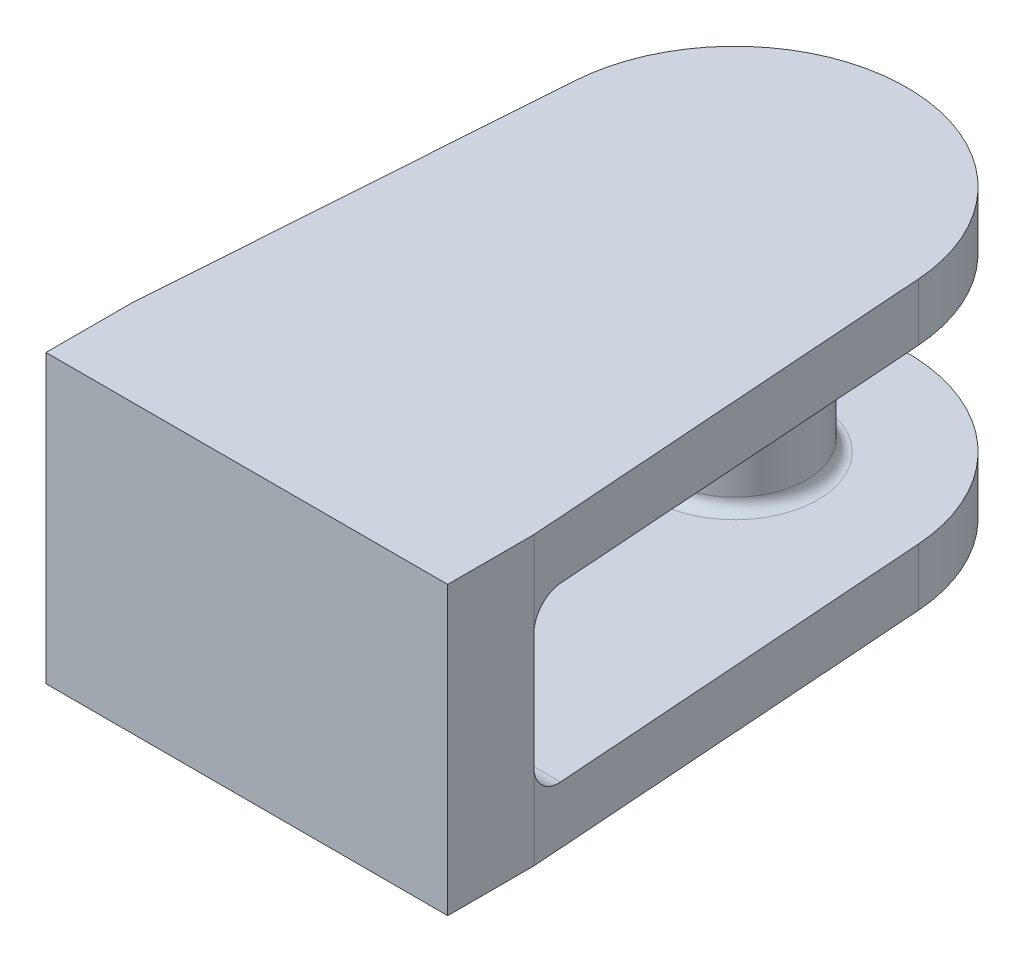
from build123d import *

# Parameters (mm, degrees)
SKETCH1_R      = 15.875
EXTRUDE1_DEPTH = 38.1
EXTRUDE2_DEPTH = 12.7
EXTRUDE5_START = 12.7
EXTRUDE5_DEPTH = 12.7
SKETCH6_W      = 88.9
SKETCH6_H      = 63.5
EXTRUDE6_DEPTH = 19.05
FILLET3_R      = 6.35
FILLET4_R      = 2.54


with BuildPart() as part:
    # Sketch1 → Extrude1 (new body)
    with BuildSketch(Plane(origin=(0, 0, 0), x_dir=(1, 0, 0), z_dir=(0, 1, 0))):
        with Locations(Location((0, 0, 0), (0, 0, 90))):
            Circle(SKETCH1_R)
    extrude(amount=EXTRUDE1_DEPTH)

    # Sketch2 → Extrude2 (add)
    with BuildSketch(Plane(origin=(0, 38.1, 0), x_dir=(1, 0, 0), z_dir=(0, 1, 0))):
        with BuildLine():
            Line((-44.45, -88.9), (-38.006017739, 2.674437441))
            ThreePointArc((-38.006017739, 2.674437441), (0, 38.1), (38.006017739, 2.674437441))
            Line((38.006017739, 2.674437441), (44.45, -88.9))
            Line((44.45, -88.9), (-44.45, -88.9))
        make_face()
    extrude(amount=EXTRUDE2_DEPTH)

    # Sketch5 → Extrude5 (add)
    with BuildSketch(Plane.XZ.offset(EXTRUDE5_START)):
        with BuildLine():
            Line((38.006017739, -2.674437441), (44.45, 88.9))
            Line((44.45, 88.9), (-44.45, 88.9))
            Line((-44.45, 88.9), (-38.006017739, -2.674437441))
            ThreePointArc((-38.006017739, -2.674437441), (0, -38.1), (38.006017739, -2.674437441))
        make_face()
    extrude(amount=-EXTRUDE5_DEPTH)

    # Sketch6 → Extrude6 (add)
    with BuildSketch(Plane.XY.offset(88.9)):
        with Locations((0, 19.05)):
            Rectangle(SKETCH6_W, SKETCH6_H)
    extrude(amount=EXTRUDE6_DEPTH)

    # Fillet3
    fillet3_edges = [part.edges().sort_by_distance(p)[0] for p in [
        (0, 0, 88.9),
        (0, 38.1, 88.9),
    ]]
    fillet(fillet3_edges, radius=FILLET3_R)

    # Fillet4
    fillet4_edges = [part.edges().sort_by_distance(p)[0] for p in [
        (0, 0, 15.875),
        (0, 38.1, 15.875),
    ]]
    fillet(fillet4_edges, radius=FILLET4_R)


solid = part.part
